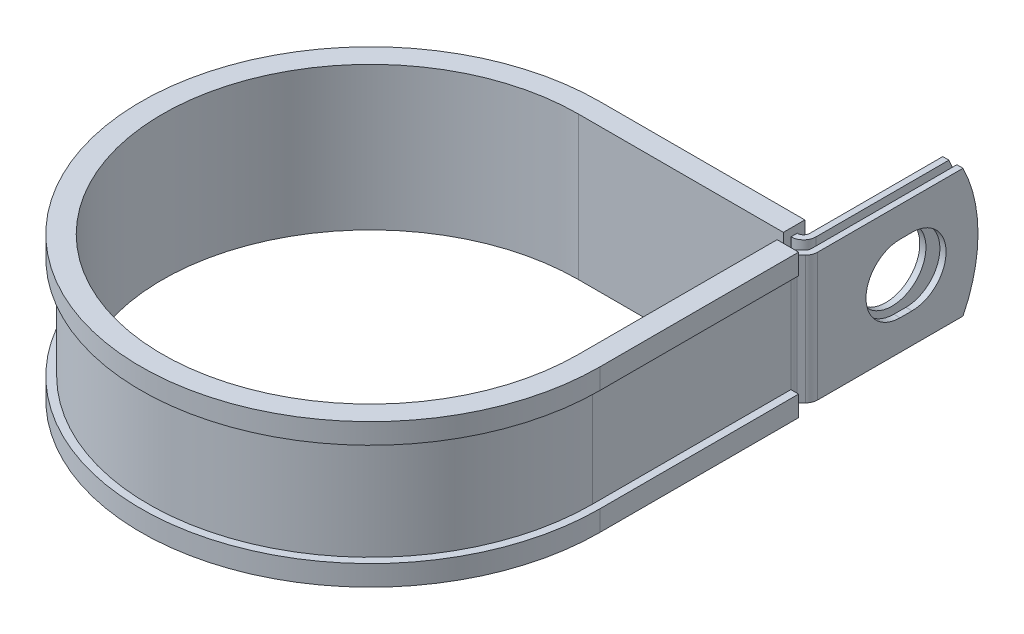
from build123d import *

# Parameters (mm, degrees)
EXTRUDE_THIN1_DEPTH = 12.7
SKETCH2_R           = 6.7437
CUT_EXTRUDE1_DEPTH  = 1.2192
CUT_EXTRUDE2_DEPTH  = 1.2192
CUT_EXTRUDE3_DEPTH  = 115.493587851


with BuildPart() as part:
    # Sketch1 → Extrude-Thin1 (new, symmetric)
    with BuildSketch(Plane(origin=(0, 0, 0), x_dir=(1, 0, 0), z_dir=(0, 1, 0))):
        with BuildLine():
            Line((44.6964698, 74.5998), (44.6964698, 42.799))
            ThreePointArc((44.6964698, 42.799), (44.603663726, 42.332432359), (44.339374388, 41.936895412))
            Line((44.339374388, 41.936895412), (43.513190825, 41.110711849))
            ThreePointArc((43.513190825, 41.110711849), (42.984612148, 40.319637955), (42.799, 39.386502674))
            Line((42.799, 39.386502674), (42.799, 0))
            ThreePointArc((42.799, 0), (-30.263463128, -30.263463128), (0, 42.799))
            Line((0, 42.799), (40.6832698, 42.799))
            ThreePointArc((40.6832698, 42.799), (42.407478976, 43.513190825), (43.1216698, 45.2374))
            Line((43.1216698, 45.2374), (43.1216698, 74.5998))
            Line((43.1216698, 74.5998), (41.9024698, 74.5998))
            Line((41.9024698, 74.5998), (41.9024698, 45.2374))
            ThreePointArc((41.9024698, 45.2374), (41.545374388, 44.375295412), (40.6832698, 44.0182))
            Line((40.6832698, 44.0182), (0, 44.0182))
            ThreePointArc((0, 44.0182), (-31.125567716, -31.125567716), (44.0182, 0))
            Line((44.0182, 0), (44.0182, 39.386502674))
            ThreePointArc((44.0182, 39.386502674), (44.111006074, 39.853070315), (44.375295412, 40.248607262))
            Line((44.375295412, 40.248607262), (45.201478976, 41.074790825))
            ThreePointArc((45.201478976, 41.074790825), (45.730057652, 41.865864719), (45.9156698, 42.799))
            Line((45.9156698, 42.799), (45.9156698, 74.5998))
            Line((45.9156698, 74.5998), (44.6964698, 74.5998))
        make_face()
    extrude(amount=EXTRUDE_THIN1_DEPTH, both=True)

    # Sketch2 → Cut-Extrude1 (cut)
    with BuildSketch(Plane.ZY.offset(-41.9024698)):
        with Locations((-60.325, 0)):
            Circle(SKETCH2_R)
    extrude(amount=-CUT_EXTRUDE1_DEPTH, mode=Mode.SUBTRACT)

    # Sketch3 → Cut-Extrude2 (cut)
    with BuildSketch(Plane(origin=(45.9156698, 0, 0), x_dir=(0, 0, -1), z_dir=(1, 0, 0))):
        with BuildLine():
            Line((59.1312, 6.7437), (61.5188, 6.7437))
            ThreePointArc((61.5188, 6.7437), (68.2625, 0), (61.5188, -6.7437))
            Line((61.5188, -6.7437), (59.1312, -6.7437))
            ThreePointArc((59.1312, -6.7437), (52.3875, 0), (59.1312, 6.7437))
        make_face()
    extrude(amount=-CUT_EXTRUDE2_DEPTH, mode=Mode.SUBTRACT)

    # Sketch4 → Cut-Extrude3 (cut, through all)
    with BuildSketch(Plane.ZY.offset(-41.9024698)):
        with BuildLine():
            Line((-71.622468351, 12.7), (-74.5998, 12.7))
            Line((-74.5998, 12.7), (-74.5998, 0))
            ThreePointArc((-74.5998, 0), (-73.845511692, 6.522164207), (-71.622468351, 12.7))
        make_face()
        with BuildLine():
            ThreePointArc((-71.622468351, -12.7), (-73.845511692, -6.522164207), (-74.5998, 0))
            Line((-74.5998, 0), (-74.5998, -12.7))
            Line((-74.5998, -12.7), (-71.622468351, -12.7))
        make_face()
    extrude(amount=-CUT_EXTRUDE3_DEPTH, mode=Mode.SUBTRACT)

    # Sweep1: sweep along a path in Sketch6
    with BuildLine(Plane(origin=(0, 12.7, 0), x_dir=(1, 0, 0), z_dir=(0, 1, 0))) as sweep1_path:
        Line((41.275, 39.386502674), (41.275, 0))
        ThreePointArc((41.275, 0), (-29.185832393, -29.185832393), (0, 41.275))
        Line((0, 41.275), (40.6324698, 41.275))
    # Sketch5 → Sweep1 (sweep)
    with BuildSketch(Plane(origin=(0, 0, -39.386502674), x_dir=(-1, 0, 0), z_dir=(0, 0, -1))):
        Polygon((-44.0182, 12.7), (-42.799, 12.7), (-42.799, -12.7), (-44.0182, -12.7), (-44.0182, -10.16), (-45.5422, -10.16), (-45.5422, -14.224), (-41.275, -14.224), (-41.275, 14.224), (-45.5422, 14.224), (-45.5422, 10.16), (-44.0182, 10.16), align=None)
    sweep(path=sweep1_path.line)


solid = part.part
